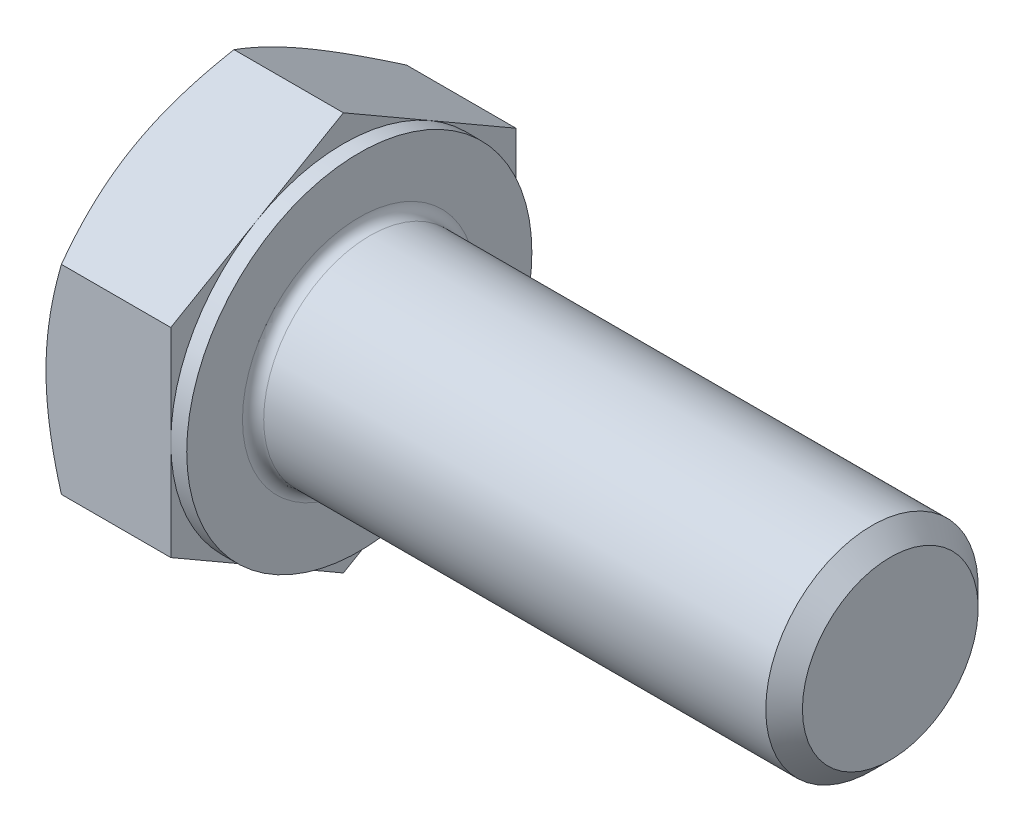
ISO-10303-21;
HEADER;
FILE_DESCRIPTION(('STEP AP214'),'2;1');
FILE_NAME('part.step','',(''),(''),'','','');
FILE_SCHEMA(('AUTOMOTIVE_DESIGN { 1 0 10303 214 1 1 1 1 }'));
ENDSEC;
DATA;
#1=APPLICATION_CONTEXT('core data for automotive mechanical design processes');
#2=APPLICATION_PROTOCOL_DEFINITION('international standard','automotive_design',2000,#1);
#3=PRODUCT_CONTEXT('',#1,'mechanical');
#4=PRODUCT('Part','Part','',(#3));
#5=PRODUCT_RELATED_PRODUCT_CATEGORY('part','',(#4));
#6=PRODUCT_DEFINITION_FORMATION('','',#4);
#7=PRODUCT_DEFINITION_CONTEXT('part definition',#1,'design');
#8=PRODUCT_DEFINITION('design','',#6,#7);
#9=PRODUCT_DEFINITION_SHAPE('','',#8);
#10=(LENGTH_UNIT() NAMED_UNIT(*) SI_UNIT(.MILLI.,.METRE.));
#11=(NAMED_UNIT(*) PLANE_ANGLE_UNIT() SI_UNIT($,.RADIAN.));
#12=(NAMED_UNIT(*) SI_UNIT($,.STERADIAN.) SOLID_ANGLE_UNIT());
#13=UNCERTAINTY_MEASURE_WITH_UNIT(LENGTH_MEASURE(1.E-05),#10,'distance_accuracy_value','');
#14=(GEOMETRIC_REPRESENTATION_CONTEXT(3) GLOBAL_UNCERTAINTY_ASSIGNED_CONTEXT((#13)) GLOBAL_UNIT_ASSIGNED_CONTEXT((#10,
#11,#12)) REPRESENTATION_CONTEXT('',''));
#15=CARTESIAN_POINT('',(0.,0.,0.));
#16=DIRECTION('',(0.,0.,1.));
#17=DIRECTION('',(1.,0.,0.));
#18=AXIS2_PLACEMENT_3D('',#15,#16,#17);
#19=CARTESIAN_POINT('',(5.30000000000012,7.50555349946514,0.));
#20=DIRECTION('',(1.00000000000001,0.,0.));
#21=DIRECTION('',(0.,0.,-1.00000000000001));
#22=AXIS2_PLACEMENT_3D('',#19,#20,#21);
#23=PLANE('',#22);
#24=CARTESIAN_POINT('',(5.30000000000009,0.,0.));
#25=DIRECTION('',(1.00000000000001,0.,0.));
#26=DIRECTION('',(0.,0.,-1.00000000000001));
#27=AXIS2_PLACEMENT_3D('',#24,#25,#26);
#28=CIRCLE('',#27,4.4);
#29=CARTESIAN_POINT('',(5.30000000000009,0.,-4.40000000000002));
#30=VERTEX_POINT('',#29);
#31=EDGE_CURVE('E40',#30,#30,#28,.F.);
#32=ORIENTED_EDGE('',*,*,#31,.T.);
#33=EDGE_LOOP('',(#32));
#34=FACE_BOUND('',#33,.T.);
#35=CARTESIAN_POINT('',(5.30000000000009,0.,0.));
#36=DIRECTION('',(1.00000000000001,0.,0.));
#37=DIRECTION('',(0.,0.,-1.00000000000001));
#38=AXIS2_PLACEMENT_3D('',#35,#36,#37);
#39=CIRCLE('',#38,6.5);
#40=CARTESIAN_POINT('',(5.30000000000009,0.,-6.50000000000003));
#41=VERTEX_POINT('',#40);
#42=EDGE_CURVE('E291',#41,#41,#39,.T.);
#43=ORIENTED_EDGE('',*,*,#42,.T.);
#44=EDGE_LOOP('',(#43));
#45=FACE_BOUND('',#44,.T.);
#46=ADVANCED_FACE('F32',(#34,#45),#23,.T.);
#47=CARTESIAN_POINT('',(0.,0.,0.));
#48=DIRECTION('',(-1.00000000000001,0.,0.));
#49=DIRECTION('',(0.,0.,1.00000000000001));
#50=AXIS2_PLACEMENT_3D('',#47,#48,#49);
#51=CYLINDRICAL_SURFACE('',#50,4.);
#52=CARTESIAN_POINT('',(5.70000000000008,0.,0.));
#53=DIRECTION('',(1.00000000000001,0.,0.));
#54=DIRECTION('',(0.,0.,-1.00000000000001));
#55=AXIS2_PLACEMENT_3D('',#52,#53,#54);
#56=CIRCLE('',#55,4.);
#57=CARTESIAN_POINT('',(5.70000000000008,0.,-4.00000000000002));
#58=VERTEX_POINT('',#57);
#59=EDGE_CURVE('E11',#58,#58,#56,.T.);
#60=ORIENTED_EDGE('',*,*,#59,.T.);
#61=EDGE_LOOP('',(#60));
#62=FACE_BOUND('',#61,.T.);
#63=CARTESIAN_POINT('',(24.6095000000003,0.,0.));
#64=DIRECTION('',(-1.00000000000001,0.,0.));
#65=DIRECTION('',(0.,0.,1.00000000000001));
#66=AXIS2_PLACEMENT_3D('',#63,#64,#65);
#67=CIRCLE('',#66,4.);
#68=CARTESIAN_POINT('',(24.6095000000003,0.,4.00000000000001));
#69=VERTEX_POINT('',#68);
#70=EDGE_CURVE('E270',#69,#69,#67,.T.);
#71=ORIENTED_EDGE('',*,*,#70,.T.);
#72=EDGE_LOOP('',(#71));
#73=FACE_BOUND('',#72,.T.);
#74=ADVANCED_FACE('F244',(#62,#73),#51,.T.);
#75=CARTESIAN_POINT('',(25.3000000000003,0.,0.));
#76=DIRECTION('',(-1.00000000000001,0.,0.));
#77=DIRECTION('',(0.,0.,1.00000000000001));
#78=AXIS2_PLACEMENT_3D('',#75,#76,#77);
#79=CONICAL_SURFACE('',#78,3.3095,0.785398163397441);
#80=ORIENTED_EDGE('',*,*,#70,.F.);
#81=EDGE_LOOP('',(#80));
#82=FACE_BOUND('',#81,.T.);
#83=CARTESIAN_POINT('',(25.3000000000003,0.,0.));
#84=DIRECTION('',(-1.00000000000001,0.,0.));
#85=DIRECTION('',(0.,0.,1.00000000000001));
#86=AXIS2_PLACEMENT_3D('',#83,#84,#85);
#87=CIRCLE('',#86,3.3095);
#88=CARTESIAN_POINT('',(25.3000000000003,0.,3.30950000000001));
#89=VERTEX_POINT('',#88);
#90=EDGE_CURVE('E268',#89,#89,#87,.T.);
#91=ORIENTED_EDGE('',*,*,#90,.T.);
#92=EDGE_LOOP('',(#91));
#93=FACE_BOUND('',#92,.T.);
#94=ADVANCED_FACE('F249',(#82,#93),#79,.T.);
#95=CARTESIAN_POINT('',(25.3000000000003,0.,0.));
#96=DIRECTION('',(-1.00000000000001,0.,0.));
#97=DIRECTION('',(0.,0.,1.00000000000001));
#98=AXIS2_PLACEMENT_3D('',#95,#96,#97);
#99=PLANE('',#98);
#100=ORIENTED_EDGE('',*,*,#90,.F.);
#101=EDGE_LOOP('',(#100));
#102=FACE_BOUND('',#101,.T.);
#103=ADVANCED_FACE('F256',(#102),#99,.F.);
#104=CARTESIAN_POINT('',(4.70000000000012,6.5,0.));
#105=DIRECTION('',(1.00000000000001,0.,0.));
#106=DIRECTION('',(0.,0.,-1.00000000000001));
#107=AXIS2_PLACEMENT_3D('',#104,#105,#106);
#108=PLANE('',#107);
#109=DIRECTION('',(0.,0.5,0.866025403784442));
#110=VECTOR('',#109,1.);
#111=CARTESIAN_POINT('',(4.70000000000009,3.75277674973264,-6.50000000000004));
#112=LINE('',#111,#110);
#113=CARTESIAN_POINT('',(4.70000000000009,3.75277674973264,-6.50000000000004));
#114=VERTEX_POINT('',#113);
#115=CARTESIAN_POINT('',(4.70000000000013,5.62916512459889,-3.25000000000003));
#116=VERTEX_POINT('',#115);
#117=EDGE_CURVE('E164',#114,#116,#112,.T.);
#118=ORIENTED_EDGE('',*,*,#117,.T.);
#119=CARTESIAN_POINT('',(4.70000000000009,0.,0.));
#120=DIRECTION('',(-1.00000000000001,0.,0.));
#121=DIRECTION('',(0.,0.,1.00000000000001));
#122=AXIS2_PLACEMENT_3D('',#119,#120,#121);
#123=CIRCLE('',#122,6.5);
#124=CARTESIAN_POINT('',(4.70000000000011,0.,-6.50000000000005));
#125=VERTEX_POINT('',#124);
#126=EDGE_CURVE('E47',#116,#125,#123,.T.);
#127=ORIENTED_EDGE('',*,*,#126,.T.);
#128=DIRECTION('',(0.,0.999999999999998,0.));
#129=VECTOR('',#128,1.);
#130=CARTESIAN_POINT('',(4.70000000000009,3.75277674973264,-6.50000000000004));
#131=LINE('',#130,#129);
#132=EDGE_CURVE('E294',#125,#114,#131,.T.);
#133=ORIENTED_EDGE('',*,*,#132,.T.);
#134=EDGE_LOOP('',(#118,#127,#133));
#135=FACE_BOUND('',#134,.T.);
#136=ADVANCED_FACE('F259',(#135),#108,.T.);
#137=CARTESIAN_POINT('',(4.70000000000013,7.50555349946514,0.));
#138=VERTEX_POINT('',#137);
#139=EDGE_CURVE('E162',#116,#138,#112,.T.);
#140=ORIENTED_EDGE('',*,*,#139,.T.);
#141=DIRECTION('',(0.,-0.5,0.866025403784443));
#142=VECTOR('',#141,1.);
#143=CARTESIAN_POINT('',(4.70000000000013,7.50555349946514,0.));
#144=LINE('',#143,#142);
#145=CARTESIAN_POINT('',(4.70000000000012,5.62916512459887,3.25000000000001));
#146=VERTEX_POINT('',#145);
#147=EDGE_CURVE('E161',#138,#146,#144,.T.);
#148=ORIENTED_EDGE('',*,*,#147,.T.);
#149=EDGE_CURVE('E150',#146,#116,#123,.T.);
#150=ORIENTED_EDGE('',*,*,#149,.T.);
#151=EDGE_LOOP('',(#140,#148,#150));
#152=FACE_BOUND('',#151,.T.);
#153=ADVANCED_FACE('F264',(#152),#108,.T.);
#154=CARTESIAN_POINT('',(4.70000000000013,3.75277674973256,6.50000000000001));
#155=VERTEX_POINT('',#154);
#156=EDGE_CURVE('E129',#146,#155,#144,.T.);
#157=ORIENTED_EDGE('',*,*,#156,.T.);
#158=DIRECTION('',(0.,-0.999999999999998,0.));
#159=VECTOR('',#158,1.);
#160=CARTESIAN_POINT('',(4.70000000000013,3.75277674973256,6.50000000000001));
#161=LINE('',#160,#159);
#162=CARTESIAN_POINT('',(4.70000000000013,0.,6.50000000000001));
#163=VERTEX_POINT('',#162);
#164=EDGE_CURVE('E123',#155,#163,#161,.T.);
#165=ORIENTED_EDGE('',*,*,#164,.T.);
#166=EDGE_CURVE('E127',#163,#146,#123,.T.);
#167=ORIENTED_EDGE('',*,*,#166,.T.);
#168=EDGE_LOOP('',(#157,#165,#167));
#169=FACE_BOUND('',#168,.T.);
#170=ADVANCED_FACE('F125',(#169),#108,.T.);
#171=CARTESIAN_POINT('',(4.70000000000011,-3.7527767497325,6.50000000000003));
#172=VERTEX_POINT('',#171);
#173=EDGE_CURVE('E133',#163,#172,#161,.T.);
#174=ORIENTED_EDGE('',*,*,#173,.T.);
#175=DIRECTION('',(0.,-0.5,-0.866025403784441));
#176=VECTOR('',#175,1.);
#177=CARTESIAN_POINT('',(4.70000000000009,-7.50555349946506,0.));
#178=LINE('',#177,#176);
#179=CARTESIAN_POINT('',(4.70000000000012,-5.62916512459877,3.25000000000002));
#180=VERTEX_POINT('',#179);
#181=EDGE_CURVE('E140',#172,#180,#178,.T.);
#182=ORIENTED_EDGE('',*,*,#181,.T.);
#183=EDGE_CURVE('E137',#180,#163,#123,.T.);
#184=ORIENTED_EDGE('',*,*,#183,.T.);
#185=EDGE_LOOP('',(#174,#182,#184));
#186=FACE_BOUND('',#185,.T.);
#187=ADVANCED_FACE('F138',(#186),#108,.T.);
#188=CARTESIAN_POINT('',(4.70000000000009,-7.50555349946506,0.));
#189=VERTEX_POINT('',#188);
#190=EDGE_CURVE('E156',#180,#189,#178,.T.);
#191=ORIENTED_EDGE('',*,*,#190,.T.);
#192=DIRECTION('',(0.,0.5,-0.866025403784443));
#193=VECTOR('',#192,1.);
#194=CARTESIAN_POINT('',(4.70000000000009,-3.7527767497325,-6.50000000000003));
#195=LINE('',#194,#193);
#196=CARTESIAN_POINT('',(4.70000000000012,-5.62916512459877,-3.25000000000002));
#197=VERTEX_POINT('',#196);
#198=EDGE_CURVE('E332',#189,#197,#195,.T.);
#199=ORIENTED_EDGE('',*,*,#198,.T.);
#200=EDGE_CURVE('E144',#197,#180,#123,.T.);
#201=ORIENTED_EDGE('',*,*,#200,.T.);
#202=EDGE_LOOP('',(#191,#199,#201));
#203=FACE_BOUND('',#202,.T.);
#204=ADVANCED_FACE('F333',(#203),#108,.T.);
#205=CARTESIAN_POINT('',(4.70000000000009,-3.7527767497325,-6.50000000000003));
#206=VERTEX_POINT('',#205);
#207=EDGE_CURVE('E151',#197,#206,#195,.T.);
#208=ORIENTED_EDGE('',*,*,#207,.T.);
#209=EDGE_CURVE('E295',#206,#125,#131,.T.);
#210=ORIENTED_EDGE('',*,*,#209,.T.);
#211=EDGE_CURVE('E302',#125,#197,#123,.T.);
#212=ORIENTED_EDGE('',*,*,#211,.T.);
#213=EDGE_LOOP('',(#208,#210,#212));
#214=FACE_BOUND('',#213,.T.);
#215=ADVANCED_FACE('F265',(#214),#108,.T.);
#216=CARTESIAN_POINT('',(0.,0.,0.));
#217=DIRECTION('',(-1.00000000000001,0.,0.));
#218=DIRECTION('',(0.,0.,1.00000000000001));
#219=AXIS2_PLACEMENT_3D('',#216,#217,#218);
#220=CYLINDRICAL_SURFACE('',#219,6.5);
#221=ORIENTED_EDGE('',*,*,#126,.F.);
#222=ORIENTED_EDGE('',*,*,#149,.F.);
#223=ORIENTED_EDGE('',*,*,#166,.F.);
#224=ORIENTED_EDGE('',*,*,#183,.F.);
#225=ORIENTED_EDGE('',*,*,#200,.F.);
#226=ORIENTED_EDGE('',*,*,#211,.F.);
#227=EDGE_LOOP('',(#221,#222,#223,#224,#225,#226));
#228=FACE_BOUND('',#227,.T.);
#229=ORIENTED_EDGE('',*,*,#42,.F.);
#230=EDGE_LOOP('',(#229));
#231=FACE_BOUND('',#230,.T.);
#232=ADVANCED_FACE('F147',(#228,#231),#220,.T.);
#233=CARTESIAN_POINT('',(0.,7.50555349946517,0.));
#234=DIRECTION('',(1.00000000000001,0.,0.));
#235=DIRECTION('',(0.,0.,-1.00000000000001));
#236=AXIS2_PLACEMENT_3D('',#233,#234,#235);
#237=PLANE('',#236);
#238=CARTESIAN_POINT('',(0.,0.,0.));
#239=DIRECTION('',(1.00000000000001,0.,0.));
#240=DIRECTION('',(0.,0.,-1.00000000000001));
#241=AXIS2_PLACEMENT_3D('',#238,#239,#240);
#242=CIRCLE('',#241,6.5);
#243=CARTESIAN_POINT('',(0.,0.,-6.50000000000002));
#244=VERTEX_POINT('',#243);
#245=CARTESIAN_POINT('',(0.,5.62916512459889,-3.25));
#246=VERTEX_POINT('',#245);
#247=EDGE_CURVE('E290',#244,#246,#242,.T.);
#248=ORIENTED_EDGE('',*,*,#247,.F.);
#249=CARTESIAN_POINT('',(0.,-5.62916512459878,-3.25));
#250=VERTEX_POINT('',#249);
#251=EDGE_CURVE('E286',#250,#244,#242,.T.);
#252=ORIENTED_EDGE('',*,*,#251,.F.);
#253=CARTESIAN_POINT('',(0.,-5.62916512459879,3.25000000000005));
#254=VERTEX_POINT('',#253);
#255=EDGE_CURVE('E289',#254,#250,#242,.T.);
#256=ORIENTED_EDGE('',*,*,#255,.F.);
#257=CARTESIAN_POINT('',(0.,0.,6.50000000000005));
#258=VERTEX_POINT('',#257);
#259=EDGE_CURVE('E325',#258,#254,#242,.T.);
#260=ORIENTED_EDGE('',*,*,#259,.F.);
#261=CARTESIAN_POINT('',(0.,0.,0.));
#262=DIRECTION('',(-1.00000000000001,0.,0.));
#263=DIRECTION('',(0.,0.,1.00000000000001));
#264=AXIS2_PLACEMENT_3D('',#261,#262,#263);
#265=CIRCLE('',#264,6.5);
#266=CARTESIAN_POINT('',(0.,5.62916512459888,3.25000000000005));
#267=VERTEX_POINT('',#266);
#268=EDGE_CURVE('E165',#258,#267,#265,.T.);
#269=ORIENTED_EDGE('',*,*,#268,.T.);
#270=EDGE_CURVE('E348',#246,#267,#242,.T.);
#271=ORIENTED_EDGE('',*,*,#270,.F.);
#272=EDGE_LOOP('',(#248,#252,#256,#260,#269,#271));
#273=FACE_BOUND('',#272,.T.);
#274=ADVANCED_FACE('F194',(#273),#237,.F.);
#275=CARTESIAN_POINT('',(0.,0.,0.));
#276=DIRECTION('',(1.00000000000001,0.,0.));
#277=DIRECTION('',(0.,0.,-1.00000000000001));
#278=AXIS2_PLACEMENT_3D('',#275,#276,#277);
#279=CONICAL_SURFACE('',#278,6.5,1.0471975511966);
#280=CARTESIAN_POINT('',(0.580623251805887,3.75266127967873,6.5002));
#281=CARTESIAN_POINT('',(0.533004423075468,3.83515161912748,6.35732254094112));
#282=CARTESIAN_POINT('',(0.487546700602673,3.91794952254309,6.21391236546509));
#283=CARTESIAN_POINT('',(0.401548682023,4.08421773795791,5.9259273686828));
#284=CARTESIAN_POINT('',(0.361010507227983,4.16768832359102,5.78135207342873));
#285=CARTESIAN_POINT('',(0.247571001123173,4.41943655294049,5.34531134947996));
#286=CARTESIAN_POINT('',(0.183047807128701,4.58870793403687,5.05212471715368));
#287=CARTESIAN_POINT('',(0.107386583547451,4.84201947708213,4.61337625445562));
#288=CARTESIAN_POINT('',(0.0858328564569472,4.92530276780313,4.4691253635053));
#289=CARTESIAN_POINT('',(0.0496903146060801,5.09224566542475,4.17997178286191));
#290=CARTESIAN_POINT('',(0.0351008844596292,5.17590523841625,4.03506915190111));
#291=CARTESIAN_POINT('',(0.0132587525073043,5.34336968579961,3.74501222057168));
#292=CARTESIAN_POINT('',(0.00599772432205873,5.42717428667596,3.59985839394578));
#293=CARTESIAN_POINT('',(-0.00103969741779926,5.59485627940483,3.30942466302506));
#294=CARTESIAN_POINT('',(-0.000816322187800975,5.67873366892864,3.16414476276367));
#295=CARTESIAN_POINT('',(0.0100834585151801,5.90853103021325,2.76612405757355));
#296=CARTESIAN_POINT('',(0.0283818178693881,6.05437578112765,2.51351353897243));
#297=CARTESIAN_POINT('',(0.0864063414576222,6.34509659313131,2.00997032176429));
#298=CARTESIAN_POINT('',(0.126152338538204,6.48997163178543,1.7590393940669));
#299=CARTESIAN_POINT('',(0.225505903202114,6.78127752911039,1.25448277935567));
#300=CARTESIAN_POINT('',(0.285534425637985,6.92767163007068,1.00092075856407));
#301=CARTESIAN_POINT('',(0.421774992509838,7.21827667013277,0.497578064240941));
#302=CARTESIAN_POINT('',(0.497955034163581,7.36249133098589,0.247790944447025));
#303=CARTESIAN_POINT('',(0.580623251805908,7.50566896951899,-0.000199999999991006));
#304=B_SPLINE_CURVE_WITH_KNOTS('',3,(#280,#281,#282,#283,#284,#285,#286,#287,#288,#289,#290,
#291,#292,#293,#294,#295,#296,#297,#298,#299,#300,#301,#302,#303),.UNSPECIFIED.,.F.,.F.,(4,2,2,
2,2,2,2,2,2,2,2,4),(0.,0.515105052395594,1.03043143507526,2.06322554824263,2.56697389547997,
3.07067772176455,3.57380860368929,4.07692394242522,4.95279354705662,5.82947446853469,
6.72559912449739,7.6199645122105),.UNSPECIFIED.);
#305=CARTESIAN_POINT('',(0.580556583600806,7.50555349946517,0.));
#306=VERTEX_POINT('',#305);
#307=EDGE_CURVE('E213',#267,#306,#304,.T.);
#308=ORIENTED_EDGE('',*,*,#307,.T.);
#309=CARTESIAN_POINT('',(0.580623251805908,7.50566896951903,0.000200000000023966));
#310=CARTESIAN_POINT('',(0.533004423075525,7.4231786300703,-0.142677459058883));
#311=CARTESIAN_POINT('',(0.487546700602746,7.3403807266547,-0.286087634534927));
#312=CARTESIAN_POINT('',(0.401548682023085,7.17411251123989,-0.574072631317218));
#313=CARTESIAN_POINT('',(0.361010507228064,7.09064192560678,-0.718647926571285));
#314=CARTESIAN_POINT('',(0.247571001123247,6.83889369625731,-1.15468865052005));
#315=CARTESIAN_POINT('',(0.183047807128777,6.66962231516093,-1.44787528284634));
#316=CARTESIAN_POINT('',(0.10738658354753,6.41631077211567,-1.8866237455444));
#317=CARTESIAN_POINT('',(0.0858328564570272,6.33302748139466,-2.03087463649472));
#318=CARTESIAN_POINT('',(0.0496903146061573,6.16608458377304,-2.32002821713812));
#319=CARTESIAN_POINT('',(0.0351008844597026,6.08242501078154,-2.46493084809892));
#320=CARTESIAN_POINT('',(0.0132587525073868,5.91496056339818,-2.75498777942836));
#321=CARTESIAN_POINT('',(0.00599772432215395,5.83115596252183,-2.90014160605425));
#322=CARTESIAN_POINT('',(-0.0010396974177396,5.66347396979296,-3.19057533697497));
#323=CARTESIAN_POINT('',(-0.000816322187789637,5.57959658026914,-3.33585523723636));
#324=CARTESIAN_POINT('',(0.0100834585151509,5.34979921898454,-3.73387594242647));
#325=CARTESIAN_POINT('',(0.0283818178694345,5.20395446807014,-3.98648646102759));
#326=CARTESIAN_POINT('',(0.0864063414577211,4.91323365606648,-4.49002967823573));
#327=CARTESIAN_POINT('',(0.12615233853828,4.76835861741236,-4.74096060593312));
#328=CARTESIAN_POINT('',(0.225505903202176,4.4770527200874,-5.24551722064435));
#329=CARTESIAN_POINT('',(0.285534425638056,4.33065861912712,-5.49907924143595));
#330=CARTESIAN_POINT('',(0.421774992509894,4.04005357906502,-6.00242193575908));
#331=CARTESIAN_POINT('',(0.497955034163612,3.89583891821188,-6.252209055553));
#332=CARTESIAN_POINT('',(0.580623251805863,3.75266127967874,-6.50020000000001));
#333=B_SPLINE_CURVE_WITH_KNOTS('',3,(#309,#310,#311,#312,#313,#314,#315,#316,#317,#318,#319,
#320,#321,#322,#323,#324,#325,#326,#327,#328,#329,#330,#331,#332),.UNSPECIFIED.,.F.,.F.,(4,2,2,
2,2,2,2,2,2,2,2,4),(0.,0.51510505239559,1.03043143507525,2.06322554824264,2.56697389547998,
3.07067772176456,3.5738086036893,4.07692394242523,4.95279354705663,5.8294744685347,
6.72559912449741,7.6199645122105),.UNSPECIFIED.);
#334=EDGE_CURVE('E55',#306,#246,#333,.T.);
#335=ORIENTED_EDGE('',*,*,#334,.T.);
#336=ORIENTED_EDGE('',*,*,#270,.T.);
#337=EDGE_LOOP('',(#308,#335,#336));
#338=FACE_BOUND('',#337,.T.);
#339=ADVANCED_FACE('F349',(#338),#279,.T.);
#340=CARTESIAN_POINT('',(3.18835311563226,-10.1137456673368,6.50000000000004));
#341=CARTESIAN_POINT('',(3.05034773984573,-9.82952666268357,6.50000000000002));
#342=CARTESIAN_POINT('',(2.9136561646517,-9.54465869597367,6.50000000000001));
#343=CARTESIAN_POINT('',(2.64363899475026,-8.97327978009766,6.5));
#344=CARTESIAN_POINT('',(2.51031392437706,-8.68676858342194,6.5));
#345=CARTESIAN_POINT('',(2.24710473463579,-8.11029837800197,6.5));
#346=CARTESIAN_POINT('',(2.11724300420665,-7.82032911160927,6.5));
#347=CARTESIAN_POINT('',(1.86279082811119,-7.23809540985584,6.5));
#348=CARTESIAN_POINT('',(1.73820013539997,-6.94583108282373,6.5));
#349=CARTESIAN_POINT('',(1.49176685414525,-6.34906440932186,6.5));
#350=CARTESIAN_POINT('',(1.37014257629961,-6.04447142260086,6.5));
#351=CARTESIAN_POINT('',(1.13601865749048,-5.43173420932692,6.5));
#352=CARTESIAN_POINT('',(1.02352003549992,-5.1235895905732,6.50000000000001));
#353=CARTESIAN_POINT('',(0.810575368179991,-4.50382569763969,6.5));
#354=CARTESIAN_POINT('',(0.710105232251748,-4.19221478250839,6.49999999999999));
#355=CARTESIAN_POINT('',(0.524420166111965,-3.5645201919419,6.50000000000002));
#356=CARTESIAN_POINT('',(0.439200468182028,-3.24843794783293,6.50000000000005));
#357=CARTESIAN_POINT('',(0.288524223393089,-2.61335465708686,6.50000000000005));
#358=CARTESIAN_POINT('',(0.222961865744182,-2.2943791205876,6.50000000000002));
#359=CARTESIAN_POINT('',(0.115312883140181,-1.65238219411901,6.49999999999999));
#360=CARTESIAN_POINT('',(0.0732239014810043,-1.329361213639,6.5));
#361=CARTESIAN_POINT('',(0.0304887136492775,-0.845231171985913,6.50000000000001));
#362=CARTESIAN_POINT('',(0.0196493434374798,-0.684982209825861,6.5));
#363=CARTESIAN_POINT('',(0.00475298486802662,-0.364162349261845,6.50000000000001));
#364=CARTESIAN_POINT('',(0.000695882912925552,-0.203591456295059,6.50000000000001));
#365=CARTESIAN_POINT('',(-0.000531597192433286,0.117577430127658,6.5));
#366=CARTESIAN_POINT('',(0.00229809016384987,0.278175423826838,6.49999999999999));
#367=CARTESIAN_POINT('',(0.0147726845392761,0.599108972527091,6.50000000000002));
#368=CARTESIAN_POINT('',(0.0244179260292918,0.759444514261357,6.50000000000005));
#369=CARTESIAN_POINT('',(0.0554961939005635,1.14369946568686,6.50000000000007));
#370=CARTESIAN_POINT('',(0.0801030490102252,1.36736763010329,6.50000000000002));
#371=CARTESIAN_POINT('',(0.141246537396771,1.81305591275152,6.49999999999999));
#372=CARTESIAN_POINT('',(0.177784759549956,2.03507580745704,6.5));
#373=CARTESIAN_POINT('',(0.303360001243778,2.69839633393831,6.50000000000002));
#374=CARTESIAN_POINT('',(0.408335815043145,3.1367201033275,6.50000000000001));
#375=CARTESIAN_POINT('',(0.590564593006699,3.79232112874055,6.50000000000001));
#376=CARTESIAN_POINT('',(0.656313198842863,4.01299150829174,6.50000000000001));
#377=CARTESIAN_POINT('',(0.794681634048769,4.4521885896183,6.50000000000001));
#378=CARTESIAN_POINT('',(0.867301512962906,4.67071527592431,6.50000000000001));
#379=CARTESIAN_POINT('',(1.018243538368,5.10569490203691,6.50000000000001));
#380=CARTESIAN_POINT('',(1.09656388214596,5.3221484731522,6.50000000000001));
#381=CARTESIAN_POINT('',(1.25798086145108,5.7532572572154,6.50000000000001));
#382=CARTESIAN_POINT('',(1.34107741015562,5.96791250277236,6.50000000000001));
#383=CARTESIAN_POINT('',(1.56029019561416,6.51888445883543,6.50000000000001));
#384=CARTESIAN_POINT('',(1.69936356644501,6.8540231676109,6.50000000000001));
#385=CARTESIAN_POINT('',(1.98501958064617,7.52109583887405,6.50000000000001));
#386=CARTESIAN_POINT('',(2.13160288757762,7.853029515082,6.50000000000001));
#387=CARTESIAN_POINT('',(2.43059748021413,8.51437865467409,6.50000000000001));
#388=CARTESIAN_POINT('',(2.58301057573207,8.84379329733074,6.50000000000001));
#389=CARTESIAN_POINT('',(2.89234869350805,9.50047798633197,6.50000000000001));
#390=CARTESIAN_POINT('',(3.04927357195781,9.82774810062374,6.50000000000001));
#391=CARTESIAN_POINT('',(3.36692013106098,10.480997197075,6.50000000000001));
#392=CARTESIAN_POINT('',(3.52764676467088,10.806973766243,6.50000000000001));
#393=CARTESIAN_POINT('',(3.85198555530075,11.4574882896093,6.50000000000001));
#394=CARTESIAN_POINT('',(4.01559773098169,11.782026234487,6.50000000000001));
#395=CARTESIAN_POINT('',(4.50986184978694,12.753746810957,6.50000000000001));
#396=CARTESIAN_POINT('',(4.8439999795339,13.3991555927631,6.50000000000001));
#397=CARTESIAN_POINT('',(5.48575990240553,14.623977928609,6.50000000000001));
#398=CARTESIAN_POINT('',(5.79279643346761,15.2036995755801,6.50000000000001));
#399=CARTESIAN_POINT('',(6.41069188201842,16.3611382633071,6.50000000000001));
#400=CARTESIAN_POINT('',(6.72155098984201,16.9388552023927,6.50000000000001));
#401=CARTESIAN_POINT('',(7.34519775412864,18.0910273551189,6.50000000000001));
#402=CARTESIAN_POINT('',(7.6579769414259,18.6654871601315,6.50000000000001));
#403=CARTESIAN_POINT('',(8.28574397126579,19.813148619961,6.50000000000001));
#404=CARTESIAN_POINT('',(8.60073166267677,20.3863503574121,6.50000000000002));
#405=CARTESIAN_POINT('',(8.91652967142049,20.9591024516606,6.50000000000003));
#406=B_SPLINE_CURVE_WITH_KNOTS('',3,(#340,#341,#342,#343,#344,#345,#346,#347,#348,#349,#350,
#351,#352,#353,#354,#355,#356,#357,#358,#359,#360,#361,#362,#363,#364,#365,#366,#367,#368,#369,
#370,#371,#372,#373,#374,#375,#376,#377,#378,#379,#380,#381,#382,#383,#384,#385,#386,#387,#388,
#389,#390,#391,#392,#393,#394,#395,#396,#397,#398,#399,#400,#401,#402,#403,#404,#405),
.UNSPECIFIED.,.F.,.F.,(4,2,2,2,2,2,2,2,2,2,2,2,2,2,2,2,2,2,2,2,2,2,2,2,2,2,2,2,2,2,2,2,4),(0.,
0.947868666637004,1.89588406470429,2.8490032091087,3.80207763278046,4.78589774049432,
5.76982755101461,6.75175256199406,7.73337005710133,8.70960474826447,9.68574140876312,
10.1674651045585,10.6491807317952,11.1309009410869,11.612644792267,12.2873175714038,
12.9620802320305,14.3123184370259,15.0030310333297,15.6937486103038,16.3842486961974,
17.074736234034,18.1631508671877,19.2516618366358,20.3405135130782,21.4293305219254,
22.519654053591,23.6099846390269,25.7902468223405,27.7582608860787,29.7263733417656,
31.6886408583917,33.6507753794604),.UNSPECIFIED.);
#407=CARTESIAN_POINT('',(0.580556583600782,3.75277674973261,6.50000000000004));
#408=VERTEX_POINT('',#407);
#409=EDGE_CURVE('E225',#258,#408,#406,.T.);
#410=ORIENTED_EDGE('',*,*,#409,.T.);
#411=EDGE_CURVE('E224',#408,#267,#304,.T.);
#412=ORIENTED_EDGE('',*,*,#411,.T.);
#413=ORIENTED_EDGE('',*,*,#268,.F.);
#414=EDGE_LOOP('',(#410,#412,#413));
#415=FACE_BOUND('',#414,.T.);
#416=ADVANCED_FACE('F319',(#415),#279,.T.);
#417=CARTESIAN_POINT('',(0.580556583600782,-3.7527767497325,6.50000000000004));
#418=VERTEX_POINT('',#417);
#419=EDGE_CURVE('E271',#418,#258,#406,.T.);
#420=ORIENTED_EDGE('',*,*,#419,.T.);
#421=ORIENTED_EDGE('',*,*,#259,.T.);
#422=CARTESIAN_POINT('',(0.580623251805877,-7.50566896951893,-0.000199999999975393));
#423=CARTESIAN_POINT('',(0.533004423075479,-7.42317863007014,0.142677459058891));
#424=CARTESIAN_POINT('',(0.487546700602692,-7.34038072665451,0.286087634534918));
#425=CARTESIAN_POINT('',(0.401548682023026,-7.17411251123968,0.574072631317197));
#426=CARTESIAN_POINT('',(0.361010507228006,-7.09064192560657,0.718647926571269));
#427=CARTESIAN_POINT('',(0.247571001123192,-6.83889369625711,1.15468865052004));
#428=CARTESIAN_POINT('',(0.183047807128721,-6.66962231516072,1.44787528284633));
#429=CARTESIAN_POINT('',(0.107386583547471,-6.41631077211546,1.88662374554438));
#430=CARTESIAN_POINT('',(0.0858328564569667,-6.33302748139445,2.03087463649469));
#431=CARTESIAN_POINT('',(0.0496903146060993,-6.16608458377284,2.32002821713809));
#432=CARTESIAN_POINT('',(0.0351008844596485,-6.08242501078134,2.4649308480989));
#433=CARTESIAN_POINT('',(0.0132587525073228,-5.91496056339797,2.75498777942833));
#434=CARTESIAN_POINT('',(0.00599772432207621,-5.8311559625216,2.90014160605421));
#435=CARTESIAN_POINT('',(-0.00103969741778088,-5.66347396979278,3.19057533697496));
#436=CARTESIAN_POINT('',(-0.000816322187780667,-5.57959658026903,3.33585523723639));
#437=CARTESIAN_POINT('',(0.0100834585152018,-5.34979921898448,3.73387594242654));
#438=CARTESIAN_POINT('',(0.028381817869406,-5.20395446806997,3.9864864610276));
#439=CARTESIAN_POINT('',(0.0864063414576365,-4.91323365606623,4.49002967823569));
#440=CARTESIAN_POINT('',(0.126152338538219,-4.76835861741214,4.7409606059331));
#441=CARTESIAN_POINT('',(0.22550590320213,-4.4770527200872,5.24551722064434));
#442=CARTESIAN_POINT('',(0.285534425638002,-4.3306586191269,5.49907924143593));
#443=CARTESIAN_POINT('',(0.421774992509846,-4.04005357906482,6.00242193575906));
#444=CARTESIAN_POINT('',(0.497955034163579,-3.89583891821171,6.25220905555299));
#445=CARTESIAN_POINT('',(0.580623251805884,-3.75266127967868,6.50020000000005));
#446=B_SPLINE_CURVE_WITH_KNOTS('',3,(#422,#423,#424,#425,#426,#427,#428,#429,#430,#431,#432,
#433,#434,#435,#436,#437,#438,#439,#440,#441,#442,#443,#444,#445),.UNSPECIFIED.,.F.,.F.,(4,2,2,
2,2,2,2,2,2,2,2,4),(0.,0.515105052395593,1.03043143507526,2.06322554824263,2.56697389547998,
3.07067772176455,3.5738086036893,4.07692394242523,4.95279354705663,5.8294744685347,
6.7255991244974,7.6199645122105),.UNSPECIFIED.);
#447=EDGE_CURVE('E215',#254,#418,#446,.T.);
#448=ORIENTED_EDGE('',*,*,#447,.T.);
#449=EDGE_LOOP('',(#420,#421,#448));
#450=FACE_BOUND('',#449,.T.);
#451=ADVANCED_FACE('F183',(#450),#279,.T.);
#452=CARTESIAN_POINT('',(0.580556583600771,-7.5055534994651,0.));
#453=VERTEX_POINT('',#452);
#454=EDGE_CURVE('E208',#453,#254,#446,.T.);
#455=ORIENTED_EDGE('',*,*,#454,.T.);
#456=ORIENTED_EDGE('',*,*,#255,.T.);
#457=CARTESIAN_POINT('',(0.58062325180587,-3.75266127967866,-6.50020000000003));
#458=CARTESIAN_POINT('',(0.533004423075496,-3.83515161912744,-6.35732254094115));
#459=CARTESIAN_POINT('',(0.48754670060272,-3.91794952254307,-6.21391236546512));
#460=CARTESIAN_POINT('',(0.401548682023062,-4.0842177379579,-5.92592736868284));
#461=CARTESIAN_POINT('',(0.361010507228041,-4.167688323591,-5.78135207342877));
#462=CARTESIAN_POINT('',(0.247571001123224,-4.41943655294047,-5.34531134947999));
#463=CARTESIAN_POINT('',(0.183047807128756,-4.58870793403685,-5.05212471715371));
#464=CARTESIAN_POINT('',(0.107386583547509,-4.84201947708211,-4.61337625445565));
#465=CARTESIAN_POINT('',(0.0858328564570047,-4.92530276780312,-4.46912536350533));
#466=CARTESIAN_POINT('',(0.0496903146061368,-5.09224566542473,-4.17997178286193));
#467=CARTESIAN_POINT('',(0.0351008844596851,-5.17590523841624,-4.03506915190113));
#468=CARTESIAN_POINT('',(0.013258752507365,-5.34336968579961,-3.7450122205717));
#469=CARTESIAN_POINT('',(0.00599772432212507,-5.42717428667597,-3.59985839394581));
#470=CARTESIAN_POINT('',(-0.00103969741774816,-5.5948562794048,-3.30942466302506));
#471=CARTESIAN_POINT('',(-0.000816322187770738,-5.67873366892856,-3.16414476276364));
#472=CARTESIAN_POINT('',(0.010083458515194,-5.90853103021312,-2.7661240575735));
#473=CARTESIAN_POINT('',(0.0283818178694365,-6.05437578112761,-2.51351353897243));
#474=CARTESIAN_POINT('',(0.0864063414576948,-6.34509659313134,-2.00997032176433));
#475=CARTESIAN_POINT('',(0.126152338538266,-6.48997163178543,-1.75903939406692));
#476=CARTESIAN_POINT('',(0.225505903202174,-6.78127752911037,-1.25448277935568));
#477=CARTESIAN_POINT('',(0.285534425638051,-6.92767163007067,-1.00092075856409));
#478=CARTESIAN_POINT('',(0.421774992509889,-7.21827667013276,-0.497578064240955));
#479=CARTESIAN_POINT('',(0.49795503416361,-7.36249133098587,-0.24779094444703));
#480=CARTESIAN_POINT('',(0.580623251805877,-7.50566896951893,0.000200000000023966));
#481=B_SPLINE_CURVE_WITH_KNOTS('',3,(#457,#458,#459,#460,#461,#462,#463,#464,#465,#466,#467,
#468,#469,#470,#471,#472,#473,#474,#475,#476,#477,#478,#479,#480),.UNSPECIFIED.,.F.,.F.,(4,2,2,
2,2,2,2,2,2,2,2,4),(0.,0.515105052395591,1.03043143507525,2.06322554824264,2.56697389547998,
3.07067772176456,3.57380860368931,4.07692394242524,4.95279354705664,5.82947446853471,
6.72559912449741,7.61996451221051),.UNSPECIFIED.);
#482=EDGE_CURVE('E214',#250,#453,#481,.T.);
#483=ORIENTED_EDGE('',*,*,#482,.T.);
#484=EDGE_LOOP('',(#455,#456,#483));
#485=FACE_BOUND('',#484,.T.);
#486=ADVANCED_FACE('F347',(#485),#279,.T.);
#487=CARTESIAN_POINT('',(0.580556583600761,3.75277674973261,-6.49999999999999));
#488=VERTEX_POINT('',#487);
#489=EDGE_CURVE('E216',#246,#488,#333,.T.);
#490=ORIENTED_EDGE('',*,*,#489,.T.);
#491=CARTESIAN_POINT('',(3.18835311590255,-10.1137456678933,-6.50000000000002));
#492=CARTESIAN_POINT('',(3.05034774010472,-9.82952666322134,-6.50000000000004));
#493=CARTESIAN_POINT('',(2.91365616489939,-9.54465869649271,-6.50000000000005));
#494=CARTESIAN_POINT('',(2.64363899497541,-8.97327978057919,-6.50000000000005));
#495=CARTESIAN_POINT('',(2.51031392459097,-8.68676858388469,-6.50000000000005));
#496=CARTESIAN_POINT('',(2.2471047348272,-8.11029837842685,-6.50000000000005));
#497=CARTESIAN_POINT('',(2.11724300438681,-7.82032911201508,-6.50000000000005));
#498=CARTESIAN_POINT('',(1.86279082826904,-7.23809541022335,-6.50000000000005));
#499=CARTESIAN_POINT('',(1.73820013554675,-6.94583108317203,-6.50000000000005));
#500=CARTESIAN_POINT('',(1.49176685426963,-6.34906440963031,-6.50000000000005));
#501=CARTESIAN_POINT('',(1.37014257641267,-6.04447142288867,-6.50000000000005));
#502=CARTESIAN_POINT('',(1.13601865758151,-5.4317342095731,-6.50000000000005));
#503=CARTESIAN_POINT('',(1.02352003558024,-5.12358959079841,-6.50000000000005));
#504=CARTESIAN_POINT('',(0.810575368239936,-4.50382569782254,-6.50000000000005));
#505=CARTESIAN_POINT('',(0.710105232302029,-4.19221478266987,-6.50000000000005));
#506=CARTESIAN_POINT('',(0.524420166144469,-3.56452019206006,-6.50000000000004));
#507=CARTESIAN_POINT('',(0.439200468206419,-3.24843794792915,-6.50000000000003));
#508=CARTESIAN_POINT('',(0.288524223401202,-2.61335465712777,-6.50000000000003));
#509=CARTESIAN_POINT('',(0.222961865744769,-2.29437912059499,-6.50000000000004));
#510=CARTESIAN_POINT('',(0.115312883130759,-1.65238219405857,-6.50000000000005));
#511=CARTESIAN_POINT('',(0.0732239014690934,-1.32936121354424,-6.50000000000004));
#512=CARTESIAN_POINT('',(0.0304887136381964,-0.845231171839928,-6.50000000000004));
#513=CARTESIAN_POINT('',(0.0196493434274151,-0.684982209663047,-6.50000000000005));
#514=CARTESIAN_POINT('',(0.00475298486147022,-0.364162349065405,-6.50000000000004));
#515=CARTESIAN_POINT('',(0.000695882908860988,-0.203591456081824,-6.50000000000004));
#516=CARTESIAN_POINT('',(-0.000531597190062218,0.117577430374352,-6.50000000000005));
#517=CARTESIAN_POINT('',(0.00229809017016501,0.278175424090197,-6.50000000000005));
#518=CARTESIAN_POINT('',(0.0147726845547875,0.599108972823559,-6.50000000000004));
#519=CARTESIAN_POINT('',(0.0244179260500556,0.759444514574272,-6.50000000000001));
#520=CARTESIAN_POINT('',(0.0554961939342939,1.14369946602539,-6.5));
#521=CARTESIAN_POINT('',(0.0801030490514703,1.3673676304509,-6.50000000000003));
#522=CARTESIAN_POINT('',(0.141246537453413,1.81305591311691,-6.50000000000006));
#523=CARTESIAN_POINT('',(0.177784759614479,2.03507580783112,-6.50000000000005));
#524=CARTESIAN_POINT('',(0.303360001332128,2.69839633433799,-6.50000000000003));
#525=CARTESIAN_POINT('',(0.40833581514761,3.1367201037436,-6.50000000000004));
#526=CARTESIAN_POINT('',(0.590564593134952,3.79232112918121,-6.50000000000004));
#527=CARTESIAN_POINT('',(0.6563131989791,4.01299150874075,-6.50000000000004));
#528=CARTESIAN_POINT('',(0.794681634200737,4.45218859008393,-6.50000000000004));
#529=CARTESIAN_POINT('',(0.867301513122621,4.67071527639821,-6.50000000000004));
#530=CARTESIAN_POINT('',(1.01824353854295,5.10569490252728,-6.50000000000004));
#531=CARTESIAN_POINT('',(1.09656388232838,5.32214847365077,-6.50000000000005));
#532=CARTESIAN_POINT('',(1.25798086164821,5.7532572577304,-6.50000000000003));
#533=CARTESIAN_POINT('',(1.34107741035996,5.96791250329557,-6.50000000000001));
#534=CARTESIAN_POINT('',(1.56029019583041,6.51888445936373,-6.49999999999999));
#535=CARTESIAN_POINT('',(1.69936356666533,6.85402316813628,-6.50000000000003));
#536=CARTESIAN_POINT('',(1.9850195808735,7.52109583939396,-6.50000000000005));
#537=CARTESIAN_POINT('',(2.13160288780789,7.85302951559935,-6.50000000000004));
#538=CARTESIAN_POINT('',(2.43059748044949,8.51437865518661,-6.50000000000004));
#539=CARTESIAN_POINT('',(2.58301057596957,8.84379329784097,-6.50000000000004));
#540=CARTESIAN_POINT('',(2.89234869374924,9.50047798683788,-6.50000000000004));
#541=CARTESIAN_POINT('',(3.04927357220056,9.82774810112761,-6.50000000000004));
#542=CARTESIAN_POINT('',(3.36692013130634,10.4809971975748,-6.50000000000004));
#543=CARTESIAN_POINT('',(3.5276467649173,10.8069737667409,-6.50000000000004));
#544=CARTESIAN_POINT('',(3.85198555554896,11.4574882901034,-6.50000000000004));
#545=CARTESIAN_POINT('',(4.01559773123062,11.7820262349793,-6.50000000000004));
#546=CARTESIAN_POINT('',(4.5098618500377,12.7537468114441,-6.50000000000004));
#547=CARTESIAN_POINT('',(4.84399997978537,13.399155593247,-6.50000000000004));
#548=CARTESIAN_POINT('',(5.48575990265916,14.6239779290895,-6.50000000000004));
#549=CARTESIAN_POINT('',(5.79279643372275,15.2036995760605,-6.50000000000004));
#550=CARTESIAN_POINT('',(6.41069188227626,16.3611382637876,-6.50000000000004));
#551=CARTESIAN_POINT('',(6.72155099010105,16.9388552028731,-6.50000000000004));
#552=CARTESIAN_POINT('',(7.3451977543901,18.0910273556,-6.50000000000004));
#553=CARTESIAN_POINT('',(7.65797694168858,18.6654871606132,-6.50000000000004));
#554=CARTESIAN_POINT('',(8.28574397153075,19.813148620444,-6.50000000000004));
#555=CARTESIAN_POINT('',(8.6007316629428,20.3863503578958,-6.50000000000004));
#556=CARTESIAN_POINT('',(8.91652967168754,20.9591024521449,-6.50000000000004));
#557=B_SPLINE_CURVE_WITH_KNOTS('',3,(#491,#492,#493,#494,#495,#496,#497,#498,#499,#500,#501,
#502,#503,#504,#505,#506,#507,#508,#509,#510,#511,#512,#513,#514,#515,#516,#517,#518,#519,#520,
#521,#522,#523,#524,#525,#526,#527,#528,#529,#530,#531,#532,#533,#534,#535,#536,#537,#538,#539,
#540,#541,#542,#543,#544,#545,#546,#547,#548,#549,#550,#551,#552,#553,#554,#555,#556),
.UNSPECIFIED.,.F.,.F.,(4,2,2,2,2,2,2,2,2,2,2,2,2,2,2,2,2,2,2,2,2,2,2,2,2,2,2,2,2,2,2,2,4),(0.,
0.947868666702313,1.89588406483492,2.84900320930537,3.80207763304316,4.78589774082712,
5.76982755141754,6.75175256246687,7.73337005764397,8.70960474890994,9.68574140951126,
10.1674651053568,10.6491807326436,11.1309009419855,11.6126447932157,12.287317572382,
12.9620802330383,14.3123184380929,15.0030310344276,15.6937486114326,16.384248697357,
17.0747362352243,18.1631508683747,19.2516618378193,20.3405135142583,21.4293305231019,
22.5196540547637,23.6099846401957,25.7902468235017,27.7582608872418,29.7263733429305,
31.6886408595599,33.650775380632),.UNSPECIFIED.);
#558=EDGE_CURVE('E176',#488,#244,#557,.F.);
#559=ORIENTED_EDGE('',*,*,#558,.T.);
#560=ORIENTED_EDGE('',*,*,#247,.T.);
#561=EDGE_LOOP('',(#490,#559,#560));
#562=FACE_BOUND('',#561,.T.);
#563=ADVANCED_FACE('F344',(#562),#279,.T.);
#564=CARTESIAN_POINT('',(0.580556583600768,-3.75277674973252,-6.50000000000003));
#565=VERTEX_POINT('',#564);
#566=EDGE_CURVE('E177',#565,#250,#481,.T.);
#567=ORIENTED_EDGE('',*,*,#566,.T.);
#568=ORIENTED_EDGE('',*,*,#251,.T.);
#569=EDGE_CURVE('E168',#244,#565,#557,.F.);
#570=ORIENTED_EDGE('',*,*,#569,.T.);
#571=EDGE_LOOP('',(#567,#568,#570));
#572=FACE_BOUND('',#571,.T.);
#573=ADVANCED_FACE('F192',(#572),#279,.T.);
#574=CARTESIAN_POINT('',(5.30000000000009,3.75277674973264,-6.50000000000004));
#575=DIRECTION('',(0.,0.,1.00000000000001));
#576=DIRECTION('',(0.,-0.999999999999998,0.));
#577=AXIS2_PLACEMENT_3D('',#574,#575,#576);
#578=PLANE('',#577);
#579=ORIENTED_EDGE('',*,*,#209,.F.);
#580=DIRECTION('',(-1.00000000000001,0.,0.));
#581=VECTOR('',#580,1.);
#582=CARTESIAN_POINT('',(5.30000000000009,-3.75277674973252,-6.50000000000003));
#583=LINE('',#582,#581);
#584=EDGE_CURVE('E277',#206,#565,#583,.T.);
#585=ORIENTED_EDGE('',*,*,#584,.T.);
#586=ORIENTED_EDGE('',*,*,#569,.F.);
#587=ORIENTED_EDGE('',*,*,#558,.F.);
#588=DIRECTION('',(-1.00000000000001,0.,0.));
#589=VECTOR('',#588,1.);
#590=CARTESIAN_POINT('',(5.30000000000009,3.75277674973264,-6.50000000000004));
#591=LINE('',#590,#589);
#592=EDGE_CURVE('E273',#114,#488,#591,.T.);
#593=ORIENTED_EDGE('',*,*,#592,.F.);
#594=ORIENTED_EDGE('',*,*,#132,.F.);
#595=EDGE_LOOP('',(#579,#585,#586,#587,#593,#594));
#596=FACE_BOUND('',#595,.T.);
#597=ADVANCED_FACE('F187',(#596),#578,.F.);
#598=CARTESIAN_POINT('',(5.30000000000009,-3.75277674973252,-6.50000000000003));
#599=DIRECTION('',(0.,0.866025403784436,0.500000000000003));
#600=DIRECTION('',(0.,-0.5,0.866025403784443));
#601=AXIS2_PLACEMENT_3D('',#598,#599,#600);
#602=PLANE('',#601);
#603=ORIENTED_EDGE('',*,*,#198,.F.);
#604=DIRECTION('',(-1.00000000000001,0.,0.));
#605=VECTOR('',#604,1.);
#606=CARTESIAN_POINT('',(5.30000000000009,-7.50555349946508,0.));
#607=LINE('',#606,#605);
#608=EDGE_CURVE('E279',#189,#453,#607,.T.);
#609=ORIENTED_EDGE('',*,*,#608,.T.);
#610=ORIENTED_EDGE('',*,*,#482,.F.);
#611=ORIENTED_EDGE('',*,*,#566,.F.);
#612=ORIENTED_EDGE('',*,*,#584,.F.);
#613=ORIENTED_EDGE('',*,*,#207,.F.);
#614=EDGE_LOOP('',(#603,#609,#610,#611,#612,#613));
#615=FACE_BOUND('',#614,.T.);
#616=ADVANCED_FACE('F191',(#615),#602,.F.);
#617=CARTESIAN_POINT('',(5.30000000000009,-7.50555349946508,0.));
#618=DIRECTION('',(0.,0.866025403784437,-0.500000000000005));
#619=DIRECTION('',(0.,0.5,0.866025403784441));
#620=AXIS2_PLACEMENT_3D('',#617,#618,#619);
#621=PLANE('',#620);
#622=ORIENTED_EDGE('',*,*,#181,.F.);
#623=DIRECTION('',(-1.00000000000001,0.,0.));
#624=VECTOR('',#623,1.);
#625=CARTESIAN_POINT('',(5.3000000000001,-3.7527767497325,6.50000000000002));
#626=LINE('',#625,#624);
#627=EDGE_CURVE('E155',#172,#418,#626,.T.);
#628=ORIENTED_EDGE('',*,*,#627,.T.);
#629=ORIENTED_EDGE('',*,*,#447,.F.);
#630=ORIENTED_EDGE('',*,*,#454,.F.);
#631=ORIENTED_EDGE('',*,*,#608,.F.);
#632=ORIENTED_EDGE('',*,*,#190,.F.);
#633=EDGE_LOOP('',(#622,#628,#629,#630,#631,#632));
#634=FACE_BOUND('',#633,.T.);
#635=ADVANCED_FACE('F199',(#634),#621,.F.);
#636=CARTESIAN_POINT('',(5.30000000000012,3.75277674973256,6.50000000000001));
#637=DIRECTION('',(0.,0.,-1.00000000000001));
#638=DIRECTION('',(0.,0.999999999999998,0.));
#639=AXIS2_PLACEMENT_3D('',#636,#637,#638);
#640=PLANE('',#639);
#641=ORIENTED_EDGE('',*,*,#164,.F.);
#642=DIRECTION('',(-1.00000000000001,0.,0.));
#643=VECTOR('',#642,1.);
#644=CARTESIAN_POINT('',(5.30000000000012,3.75277674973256,6.50000000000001));
#645=LINE('',#644,#643);
#646=EDGE_CURVE('E282',#155,#408,#645,.T.);
#647=ORIENTED_EDGE('',*,*,#646,.T.);
#648=ORIENTED_EDGE('',*,*,#409,.F.);
#649=ORIENTED_EDGE('',*,*,#419,.F.);
#650=ORIENTED_EDGE('',*,*,#627,.F.);
#651=ORIENTED_EDGE('',*,*,#173,.F.);
#652=EDGE_LOOP('',(#641,#647,#648,#649,#650,#651));
#653=FACE_BOUND('',#652,.T.);
#654=ADVANCED_FACE('F153',(#653),#640,.F.);
#655=CARTESIAN_POINT('',(5.30000000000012,7.50555349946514,0.));
#656=DIRECTION('',(0.,-0.866025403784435,-0.500000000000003));
#657=DIRECTION('',(0.,0.5,-0.866025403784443));
#658=AXIS2_PLACEMENT_3D('',#655,#656,#657);
#659=PLANE('',#658);
#660=ORIENTED_EDGE('',*,*,#147,.F.);
#661=DIRECTION('',(-1.00000000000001,0.,0.));
#662=VECTOR('',#661,1.);
#663=CARTESIAN_POINT('',(5.30000000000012,7.50555349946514,0.));
#664=LINE('',#663,#662);
#665=EDGE_CURVE('E284',#138,#306,#664,.T.);
#666=ORIENTED_EDGE('',*,*,#665,.T.);
#667=ORIENTED_EDGE('',*,*,#307,.F.);
#668=ORIENTED_EDGE('',*,*,#411,.F.);
#669=ORIENTED_EDGE('',*,*,#646,.F.);
#670=ORIENTED_EDGE('',*,*,#156,.F.);
#671=EDGE_LOOP('',(#660,#666,#667,#668,#669,#670));
#672=FACE_BOUND('',#671,.T.);
#673=ADVANCED_FACE('F230',(#672),#659,.F.);
#674=CARTESIAN_POINT('',(5.30000000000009,3.75277674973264,-6.50000000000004));
#675=DIRECTION('',(0.,-0.866025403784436,0.500000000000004));
#676=DIRECTION('',(0.,-0.5,-0.866025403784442));
#677=AXIS2_PLACEMENT_3D('',#674,#675,#676);
#678=PLANE('',#677);
#679=ORIENTED_EDGE('',*,*,#117,.F.);
#680=ORIENTED_EDGE('',*,*,#592,.T.);
#681=ORIENTED_EDGE('',*,*,#489,.F.);
#682=ORIENTED_EDGE('',*,*,#334,.F.);
#683=ORIENTED_EDGE('',*,*,#665,.F.);
#684=ORIENTED_EDGE('',*,*,#139,.F.);
#685=EDGE_LOOP('',(#679,#680,#681,#682,#683,#684));
#686=FACE_BOUND('',#685,.T.);
#687=ADVANCED_FACE('F233',(#686),#678,.F.);
#688=CARTESIAN_POINT('',(5.70000000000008,0.,0.));
#689=DIRECTION('',(1.00000000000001,0.,0.));
#690=DIRECTION('',(0.,0.,-1.00000000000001));
#691=AXIS2_PLACEMENT_3D('',#688,#689,#690);
#692=TOROIDAL_SURFACE('',#691,4.4,0.4);
#693=ORIENTED_EDGE('',*,*,#59,.F.);
#694=EDGE_LOOP('',(#693));
#695=FACE_BOUND('',#694,.T.);
#696=ORIENTED_EDGE('',*,*,#31,.F.);
#697=EDGE_LOOP('',(#696));
#698=FACE_BOUND('',#697,.T.);
#699=ADVANCED_FACE('F34',(#695,#698),#692,.F.);
#700=CLOSED_SHELL('',(#46,#74,#94,#103,#136,#153,#170,#187,#204,#215,#232,#274,#339,#416,#451,
#486,#563,#573,#597,#616,#635,#654,#673,#687,#699));
#701=MANIFOLD_SOLID_BREP('B2',#700);
#702=ADVANCED_BREP_SHAPE_REPRESENTATION('',(#18,#701),#14);
#703=SHAPE_DEFINITION_REPRESENTATION(#9,#702);
ENDSEC;
END-ISO-10303-21;
